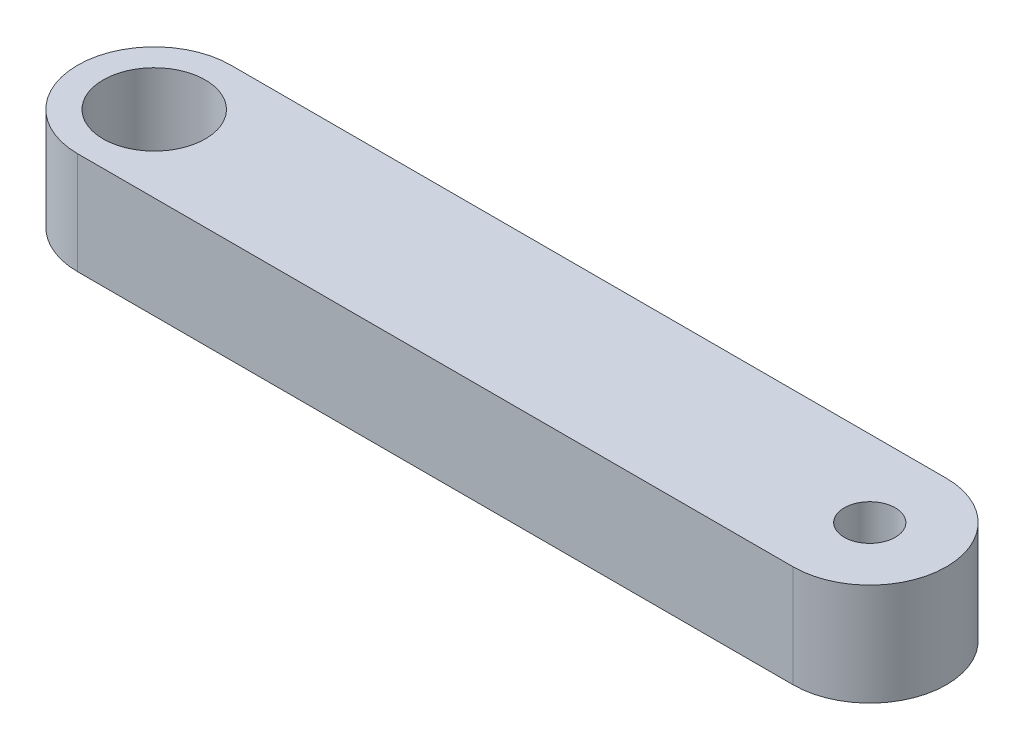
from build123d import *

# Parameters (mm, degrees)
SZKIC1_R                    = 5
SZKIC1_R_2                  = 2.5
DODANIE_WYCI_GNI_CIE1_DEPTH = 10


with BuildPart() as part:
    # Szkic1 → Dodanie-wyci_gni_cie1 (new body)
    with BuildSketch(Plane(origin=(0, 0, 0), x_dir=(1, 0, 0), z_dir=(0, 1, 0))):
        with BuildLine():
            Line((0, 7.5), (70, 7.5))
            ThreePointArc((70, 7.5), (77.5, 0), (70, -7.5))
            Line((70, -7.5), (0, -7.5))
            ThreePointArc((0, -7.5), (-7.5, 0), (0, 7.5))
        make_face()
        with Locations(Location((0, 0, 0), (0, 0, 270))):
            Circle(SZKIC1_R, mode=Mode.SUBTRACT)
        with Locations(Location((70, 0, 0), (0, 0, 270))):
            Circle(SZKIC1_R_2, mode=Mode.SUBTRACT)
    extrude(amount=DODANIE_WYCI_GNI_CIE1_DEPTH)


solid = part.part
